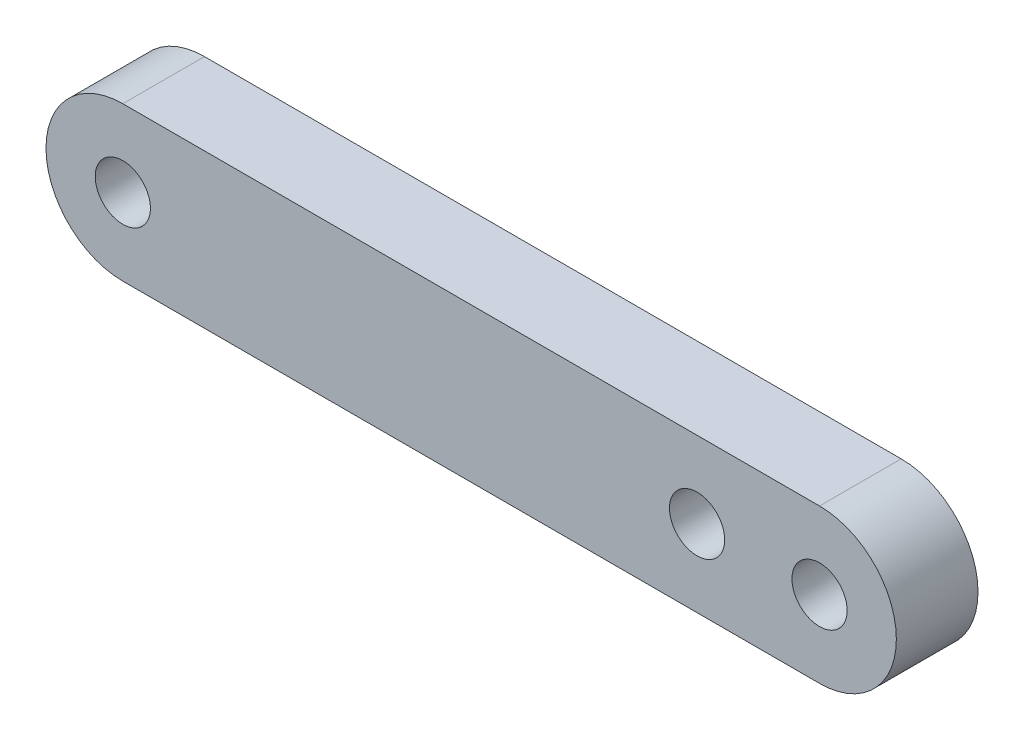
from build123d import *

# Parameters (mm, degrees)
SKETCH1_R           = 68.690297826
BOSS_EXTRUDE1_DEPTH = 203.2


with BuildPart() as part:
    # Sketch1 → Boss-Extrude1 (new body)
    with BuildSketch(Plane.XY):
        with BuildLine():
            Line((0, 191.219678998), (1734, 191.219678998))
            ThreePointArc((1734, 191.219678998), (1925.219678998, 0), (1734, -191.219678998))
            Line((1734, -191.219678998), (0, -191.219678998))
            ThreePointArc((0, -191.219678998), (-191.219678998, 0), (0, 191.219678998))
        make_face()
        Circle(SKETCH1_R, mode=Mode.SUBTRACT)
        with Locations((1734, 0)):
            Circle(SKETCH1_R, mode=Mode.SUBTRACT)
        with Locations((1429.2, 0)):
            Circle(SKETCH1_R, mode=Mode.SUBTRACT)
    extrude(amount=BOSS_EXTRUDE1_DEPTH)


solid = part.part
